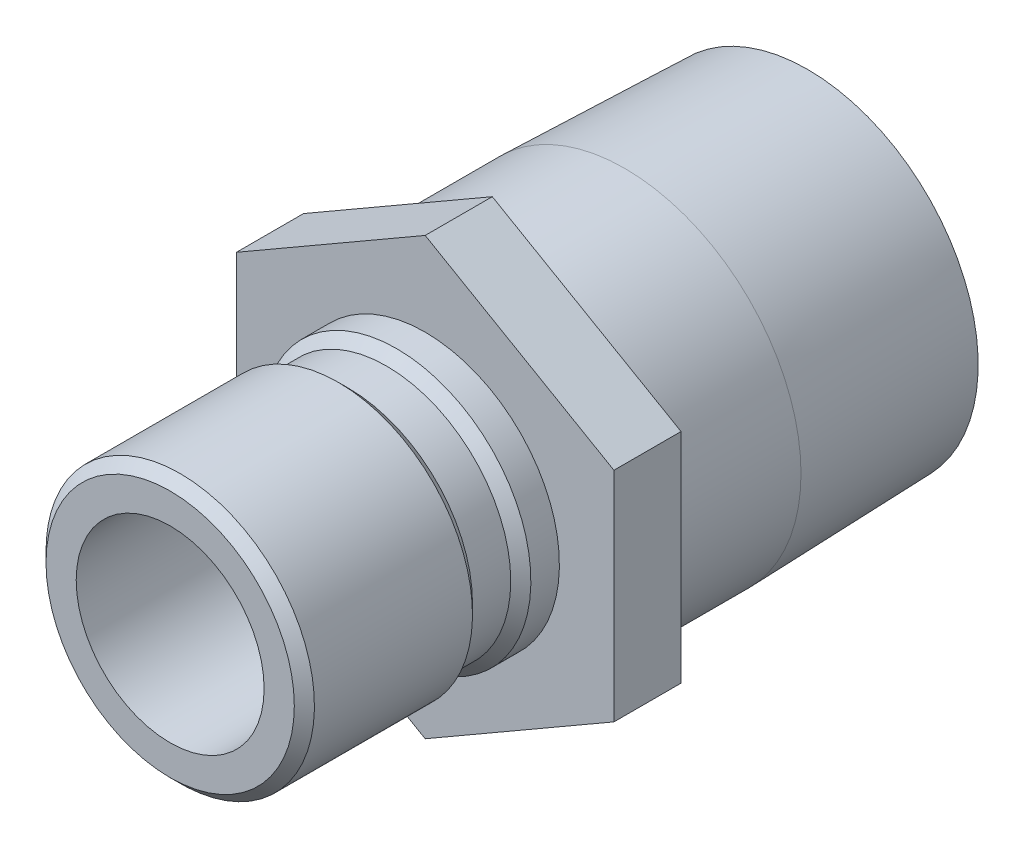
from build123d import *

# Parameters (mm, degrees)
BOSS_EXTRUDE1_START = -5.08
SKETCH2_R           = 10.4648
BOSS_EXTRUDE1_DEPTH = 5.08


with BuildPart() as part:
    # Sketch1 → Revolve1 (revolve)
    with BuildSketch(Plane(origin=(0, 0, 0), x_dir=(0, 0, -1), z_dir=(1, 0, 0))):
        Polygon((-19.304, 7.112), (-19.304, 9.398), (-18.542, 10.16), (-6.5786, 10.16), (-5.8166, 9.398), (-2.921, 9.398), (-2.159, 10.16), (0, 10.16), (0, 13.335), (15.113, 13.335), (28.956, 12.902408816), (28.956, 10.4648), (3.052715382, 10.4648), (1.27, 7.112), align=None)
    revolve(axis=Axis((0, 0, 0), (0, 0, 1)))

    # Sketch2 → Boss-Extrude1 (add)
    with BuildSketch(Plane.XY.offset(BOSS_EXTRUDE1_START)):
        Polygon((-14.2875, 8.248891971), (-14.2875, -8.248891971), (0, -16.497783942), (14.2875, -8.248891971), (14.2875, 8.248891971), (0, 16.497783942), align=None)
        with Locations(Location((0, 0, 0), (0, 0, 90))):
            Circle(SKETCH2_R, mode=Mode.SUBTRACT)
    extrude(amount=BOSS_EXTRUDE1_DEPTH)


solid = part.part
